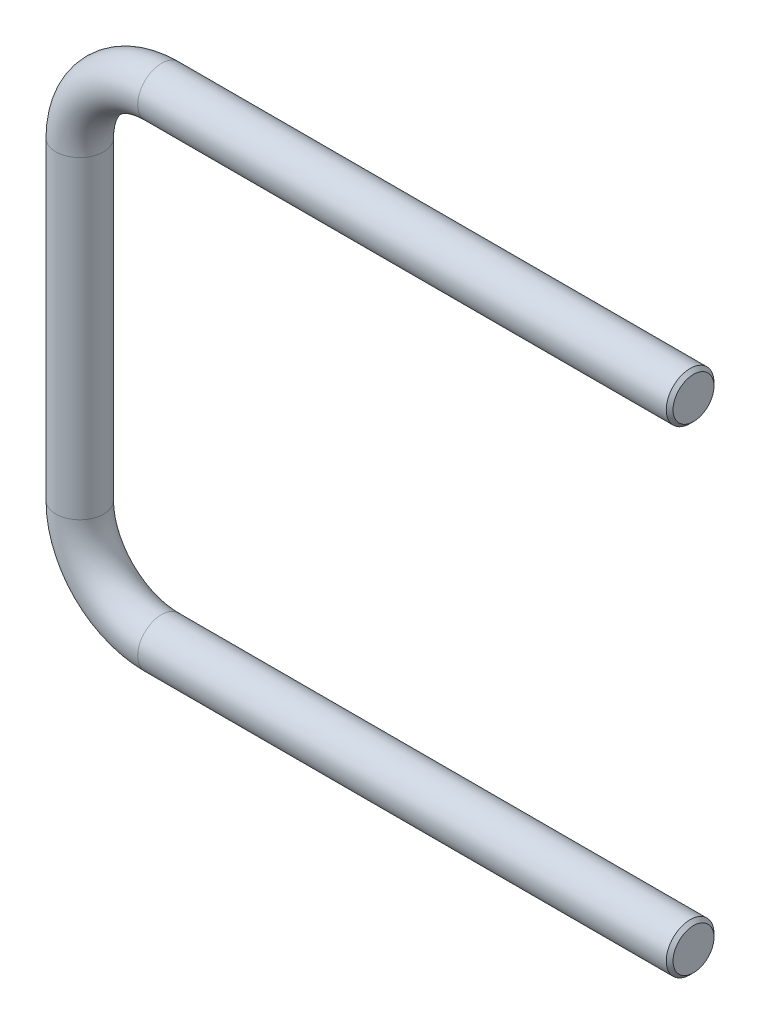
from build123d import *

# Parameters (mm, degrees)
ESQUISSE2_R     = 3.5
CHANFREIN1_SIZE = 0.5


with BuildPart() as part:
    # Base-Balayage: sweep along a path in Esquisse1
    with BuildLine(Plane.XY) as base_balayage_path:
        Line((0, 0), (-78, 0))
        ThreePointArc((-78, 0), (-86.485281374, 3.514718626), (-90, 12))
        Line((-90, 12), (-90, 58))
        ThreePointArc((-90, 58), (-86.485281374, 66.485281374), (-78, 70))
        Line((-78, 70), (0, 70))
    # Esquisse2 → Base-Balayage (sweep)
    with BuildSketch(Plane(origin=(0, 0, 0), x_dir=(0, 0, -1), z_dir=(1, 0, 0))):
        Circle(ESQUISSE2_R)
    sweep(path=base_balayage_path.line)

    # Chanfrein1
    chanfrein1_edges = [part.edges().sort_by_distance(p)[0] for p in [
        (0, 0, 3.5),
        (0, 70, 3.5),
    ]]
    chamfer(chanfrein1_edges, length=CHANFREIN1_SIZE)


solid = part.part
